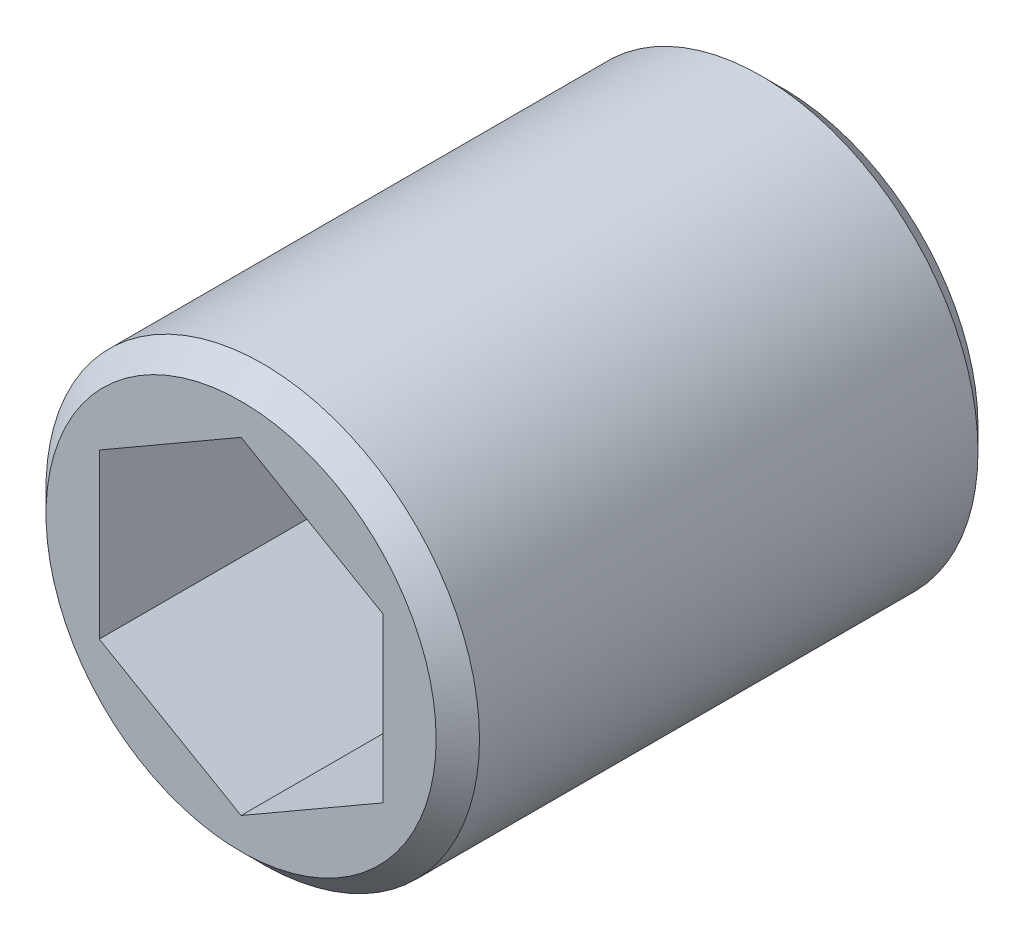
from build123d import *

# Parameters (mm, degrees)
SKETCH1_R           = 1.27
BOSS_EXTRUDE1_DEPTH = 3.175
CHAMFER1_SIZE       = 0.127
CUT_EXTRUDE1_DEPTH  = 1.5875


with BuildPart() as part:
    # Sketch1 → Boss-Extrude1 (new body)
    with BuildSketch(Plane.XY):
        Circle(SKETCH1_R)
    extrude(amount=BOSS_EXTRUDE1_DEPTH)

    # Chamfer1
    chamfer1_edges = [part.edges().sort_by_distance(p)[0] for p in [
        (-1.27, 0, 0),
        (-1.27, 0, 3.175),
    ]]
    chamfer(chamfer1_edges, length=CHAMFER1_SIZE)

    # Sketch2 → Cut-Extrude1 (cut)
    with BuildSketch(Plane.XY.offset(3.175)):
        Polygon((0, 0.959518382), (-0.830967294, 0.479759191), (-0.830967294, -0.479759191), (0, -0.959518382), (0.830967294, -0.479759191), (0.830967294, 0.479759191), align=None)
    extrude(amount=-CUT_EXTRUDE1_DEPTH, mode=Mode.SUBTRACT)


solid = part.part
